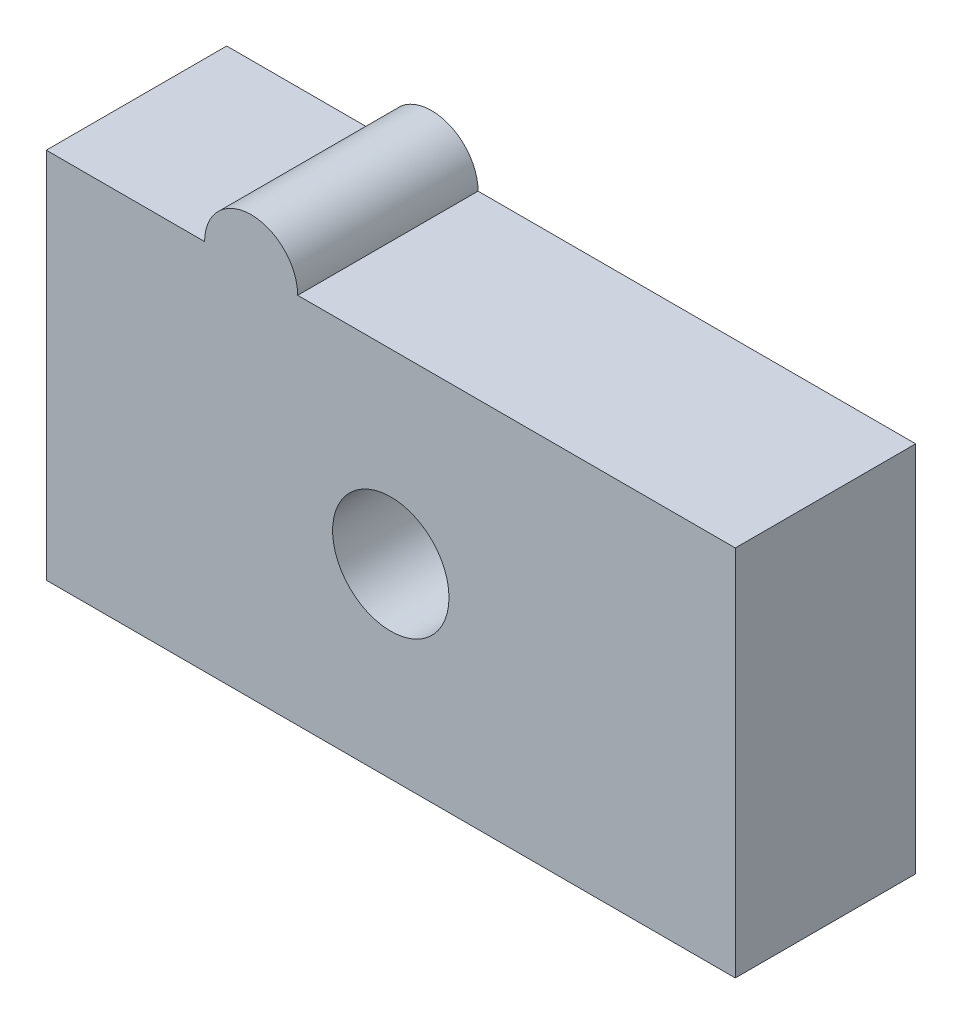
ISO-10303-21;
HEADER;
FILE_DESCRIPTION(('STEP AP214'),'2;1');
FILE_NAME('part.step','',(''),(''),'','','');
FILE_SCHEMA(('AUTOMOTIVE_DESIGN { 1 0 10303 214 1 1 1 1 }'));
ENDSEC;
DATA;
#1=APPLICATION_CONTEXT('core data for automotive mechanical design processes');
#2=APPLICATION_PROTOCOL_DEFINITION('international standard','automotive_design',2000,#1);
#3=PRODUCT_CONTEXT('',#1,'mechanical');
#4=PRODUCT('Part','Part','',(#3));
#5=PRODUCT_RELATED_PRODUCT_CATEGORY('part','',(#4));
#6=PRODUCT_DEFINITION_FORMATION('','',#4);
#7=PRODUCT_DEFINITION_CONTEXT('part definition',#1,'design');
#8=PRODUCT_DEFINITION('design','',#6,#7);
#9=PRODUCT_DEFINITION_SHAPE('','',#8);
#10=(LENGTH_UNIT() NAMED_UNIT(*) SI_UNIT(.MILLI.,.METRE.));
#11=(NAMED_UNIT(*) PLANE_ANGLE_UNIT() SI_UNIT($,.RADIAN.));
#12=(NAMED_UNIT(*) SI_UNIT($,.STERADIAN.) SOLID_ANGLE_UNIT());
#13=UNCERTAINTY_MEASURE_WITH_UNIT(LENGTH_MEASURE(1.E-05),#10,'distance_accuracy_value','');
#14=(GEOMETRIC_REPRESENTATION_CONTEXT(3) GLOBAL_UNCERTAINTY_ASSIGNED_CONTEXT((#13)) GLOBAL_UNIT_ASSIGNED_CONTEXT((#10,
#11,#12)) REPRESENTATION_CONTEXT('',''));
#15=CARTESIAN_POINT('',(0.,0.,0.));
#16=DIRECTION('',(0.,0.,1.));
#17=DIRECTION('',(1.,0.,0.));
#18=AXIS2_PLACEMENT_3D('',#15,#16,#17);
#19=CARTESIAN_POINT('',(-3.,-10.,3.875));
#20=DIRECTION('',(0.,0.,-1.));
#21=DIRECTION('',(-1.,0.,0.));
#22=AXIS2_PLACEMENT_3D('',#19,#20,#21);
#23=CYLINDRICAL_SURFACE('',#22,1.);
#24=CARTESIAN_POINT('',(-3.,-10.,0.));
#25=DIRECTION('',(0.,0.,1.));
#26=DIRECTION('',(1.,0.,0.));
#27=AXIS2_PLACEMENT_3D('',#24,#25,#26);
#28=CIRCLE('',#27,1.);
#29=CARTESIAN_POINT('',(-2.,-10.,0.));
#30=VERTEX_POINT('',#29);
#31=CARTESIAN_POINT('',(-4.,-10.,0.));
#32=VERTEX_POINT('',#31);
#33=EDGE_CURVE('E88',#30,#32,#28,.T.);
#34=ORIENTED_EDGE('',*,*,#33,.T.);
#35=DIRECTION('',(0.,0.,-1.));
#36=VECTOR('',#35,1.);
#37=CARTESIAN_POINT('',(-4.,-10.,3.875));
#38=LINE('',#37,#36);
#39=CARTESIAN_POINT('',(-4.,-10.,3.875));
#40=VERTEX_POINT('',#39);
#41=EDGE_CURVE('E11',#40,#32,#38,.T.);
#42=ORIENTED_EDGE('',*,*,#41,.F.);
#43=CARTESIAN_POINT('',(-3.,-10.,3.875));
#44=DIRECTION('',(0.,0.,1.));
#45=DIRECTION('',(1.,0.,0.));
#46=AXIS2_PLACEMENT_3D('',#43,#44,#45);
#47=CIRCLE('',#46,1.);
#48=CARTESIAN_POINT('',(-2.,-10.,3.875));
#49=VERTEX_POINT('',#48);
#50=EDGE_CURVE('E116',#49,#40,#47,.T.);
#51=ORIENTED_EDGE('',*,*,#50,.F.);
#52=DIRECTION('',(0.,0.,-1.));
#53=VECTOR('',#52,1.);
#54=CARTESIAN_POINT('',(-2.,-10.,3.875));
#55=LINE('',#54,#53);
#56=EDGE_CURVE('E101',#49,#30,#55,.T.);
#57=ORIENTED_EDGE('',*,*,#56,.T.);
#58=EDGE_LOOP('',(#34,#42,#51,#57));
#59=FACE_BOUND('',#58,.T.);
#60=ADVANCED_FACE('F32',(#59),#23,.T.);
#61=CARTESIAN_POINT('',(-7.4,-10.,3.875));
#62=DIRECTION('',(0.,-1.,0.));
#63=DIRECTION('',(1.,0.,0.));
#64=AXIS2_PLACEMENT_3D('',#61,#62,#63);
#65=PLANE('',#64);
#66=DIRECTION('',(-1.,0.,0.));
#67=VECTOR('',#66,1.);
#68=CARTESIAN_POINT('',(-7.4,-10.,0.));
#69=LINE('',#68,#67);
#70=CARTESIAN_POINT('',(-7.4,-10.,0.));
#71=VERTEX_POINT('',#70);
#72=EDGE_CURVE('E84',#32,#71,#69,.T.);
#73=ORIENTED_EDGE('',*,*,#72,.T.);
#74=DIRECTION('',(0.,0.,-1.));
#75=VECTOR('',#74,1.);
#76=CARTESIAN_POINT('',(-7.4,-10.,3.875));
#77=LINE('',#76,#75);
#78=CARTESIAN_POINT('',(-7.4,-10.,3.875));
#79=VERTEX_POINT('',#78);
#80=EDGE_CURVE('E39',#79,#71,#77,.T.);
#81=ORIENTED_EDGE('',*,*,#80,.F.);
#82=DIRECTION('',(-1.,0.,0.));
#83=VECTOR('',#82,1.);
#84=CARTESIAN_POINT('',(-7.4,-10.,3.875));
#85=LINE('',#84,#83);
#86=EDGE_CURVE('E97',#40,#79,#85,.T.);
#87=ORIENTED_EDGE('',*,*,#86,.F.);
#88=ORIENTED_EDGE('',*,*,#41,.T.);
#89=EDGE_LOOP('',(#73,#81,#87,#88));
#90=FACE_BOUND('',#89,.T.);
#91=ADVANCED_FACE('F96',(#90),#65,.F.);
#92=CARTESIAN_POINT('',(-7.4,-18.,3.875));
#93=DIRECTION('',(1.,0.,0.));
#94=DIRECTION('',(0.,0.,-1.));
#95=AXIS2_PLACEMENT_3D('',#92,#93,#94);
#96=PLANE('',#95);
#97=DIRECTION('',(0.,-1.,0.));
#98=VECTOR('',#97,1.);
#99=CARTESIAN_POINT('',(-7.4,-18.,0.));
#100=LINE('',#99,#98);
#101=CARTESIAN_POINT('',(-7.4,-18.,0.));
#102=VERTEX_POINT('',#101);
#103=EDGE_CURVE('E90',#71,#102,#100,.T.);
#104=ORIENTED_EDGE('',*,*,#103,.T.);
#105=DIRECTION('',(0.,0.,-1.));
#106=VECTOR('',#105,1.);
#107=CARTESIAN_POINT('',(-7.4,-18.,3.875));
#108=LINE('',#107,#106);
#109=CARTESIAN_POINT('',(-7.4,-18.,3.875));
#110=VERTEX_POINT('',#109);
#111=EDGE_CURVE('E132',#110,#102,#108,.T.);
#112=ORIENTED_EDGE('',*,*,#111,.F.);
#113=DIRECTION('',(0.,-1.,0.));
#114=VECTOR('',#113,1.);
#115=CARTESIAN_POINT('',(-7.4,-18.,3.875));
#116=LINE('',#115,#114);
#117=EDGE_CURVE('E119',#79,#110,#116,.T.);
#118=ORIENTED_EDGE('',*,*,#117,.F.);
#119=ORIENTED_EDGE('',*,*,#80,.T.);
#120=EDGE_LOOP('',(#104,#112,#118,#119));
#121=FACE_BOUND('',#120,.T.);
#122=ADVANCED_FACE('F136',(#121),#96,.F.);
#123=CARTESIAN_POINT('',(-7.4,-18.,3.875));
#124=DIRECTION('',(0.,1.,0.));
#125=DIRECTION('',(0.,0.,1.));
#126=AXIS2_PLACEMENT_3D('',#123,#124,#125);
#127=PLANE('',#126);
#128=DIRECTION('',(1.,0.,0.));
#129=VECTOR('',#128,1.);
#130=CARTESIAN_POINT('',(-7.4,-18.,0.));
#131=LINE('',#130,#129);
#132=CARTESIAN_POINT('',(7.4,-18.,0.));
#133=VERTEX_POINT('',#132);
#134=EDGE_CURVE('E110',#102,#133,#131,.T.);
#135=ORIENTED_EDGE('',*,*,#134,.T.);
#136=DIRECTION('',(0.,0.,-1.));
#137=VECTOR('',#136,1.);
#138=CARTESIAN_POINT('',(7.4,-18.,3.875));
#139=LINE('',#138,#137);
#140=CARTESIAN_POINT('',(7.4,-18.,3.875));
#141=VERTEX_POINT('',#140);
#142=EDGE_CURVE('E129',#141,#133,#139,.T.);
#143=ORIENTED_EDGE('',*,*,#142,.F.);
#144=DIRECTION('',(1.,0.,0.));
#145=VECTOR('',#144,1.);
#146=CARTESIAN_POINT('',(-7.4,-18.,3.875));
#147=LINE('',#146,#145);
#148=EDGE_CURVE('E121',#110,#141,#147,.T.);
#149=ORIENTED_EDGE('',*,*,#148,.F.);
#150=ORIENTED_EDGE('',*,*,#111,.T.);
#151=EDGE_LOOP('',(#135,#143,#149,#150));
#152=FACE_BOUND('',#151,.T.);
#153=ADVANCED_FACE('F142',(#152),#127,.F.);
#154=CARTESIAN_POINT('',(7.4,-18.,3.875));
#155=DIRECTION('',(-1.,0.,0.));
#156=DIRECTION('',(0.,0.,1.));
#157=AXIS2_PLACEMENT_3D('',#154,#155,#156);
#158=PLANE('',#157);
#159=DIRECTION('',(0.,1.,0.));
#160=VECTOR('',#159,1.);
#161=CARTESIAN_POINT('',(7.4,-18.,0.));
#162=LINE('',#161,#160);
#163=CARTESIAN_POINT('',(7.4,-10.,0.));
#164=VERTEX_POINT('',#163);
#165=EDGE_CURVE('E112',#133,#164,#162,.T.);
#166=ORIENTED_EDGE('',*,*,#165,.T.);
#167=DIRECTION('',(0.,0.,-1.));
#168=VECTOR('',#167,1.);
#169=CARTESIAN_POINT('',(7.4,-10.,3.875));
#170=LINE('',#169,#168);
#171=CARTESIAN_POINT('',(7.4,-10.,3.875));
#172=VERTEX_POINT('',#171);
#173=EDGE_CURVE('E126',#172,#164,#170,.T.);
#174=ORIENTED_EDGE('',*,*,#173,.F.);
#175=DIRECTION('',(0.,1.,0.));
#176=VECTOR('',#175,1.);
#177=CARTESIAN_POINT('',(7.4,-18.,3.875));
#178=LINE('',#177,#176);
#179=EDGE_CURVE('E51',#141,#172,#178,.T.);
#180=ORIENTED_EDGE('',*,*,#179,.F.);
#181=ORIENTED_EDGE('',*,*,#142,.T.);
#182=EDGE_LOOP('',(#166,#174,#180,#181));
#183=FACE_BOUND('',#182,.T.);
#184=ADVANCED_FACE('F145',(#183),#158,.F.);
#185=CARTESIAN_POINT('',(-2.,-10.,3.875));
#186=DIRECTION('',(0.,-1.,0.));
#187=DIRECTION('',(1.,0.,0.));
#188=AXIS2_PLACEMENT_3D('',#185,#186,#187);
#189=PLANE('',#188);
#190=DIRECTION('',(-1.,0.,0.));
#191=VECTOR('',#190,1.);
#192=CARTESIAN_POINT('',(-2.,-10.,0.));
#193=LINE('',#192,#191);
#194=EDGE_CURVE('E114',#164,#30,#193,.T.);
#195=ORIENTED_EDGE('',*,*,#194,.T.);
#196=ORIENTED_EDGE('',*,*,#56,.F.);
#197=DIRECTION('',(-1.,0.,0.));
#198=VECTOR('',#197,1.);
#199=CARTESIAN_POINT('',(-2.,-10.,3.875));
#200=LINE('',#199,#198);
#201=EDGE_CURVE('E46',#172,#49,#200,.T.);
#202=ORIENTED_EDGE('',*,*,#201,.F.);
#203=ORIENTED_EDGE('',*,*,#173,.T.);
#204=EDGE_LOOP('',(#195,#196,#202,#203));
#205=FACE_BOUND('',#204,.T.);
#206=ADVANCED_FACE('F147',(#205),#189,.F.);
#207=CARTESIAN_POINT('',(-3.,-10.,3.875));
#208=DIRECTION('',(0.,0.,1.));
#209=DIRECTION('',(1.,0.,0.));
#210=AXIS2_PLACEMENT_3D('',#207,#208,#209);
#211=PLANE('',#210);
#212=CARTESIAN_POINT('',(0.,-14.,3.875));
#213=DIRECTION('',(0.,0.,1.));
#214=DIRECTION('',(1.,0.,0.));
#215=AXIS2_PLACEMENT_3D('',#212,#213,#214);
#216=CIRCLE('',#215,1.25);
#217=CARTESIAN_POINT('',(1.25,-14.,3.875));
#218=VERTEX_POINT('',#217);
#219=EDGE_CURVE('E254',#218,#218,#216,.T.);
#220=ORIENTED_EDGE('',*,*,#219,.F.);
#221=EDGE_LOOP('',(#220));
#222=FACE_BOUND('',#221,.T.);
#223=ORIENTED_EDGE('',*,*,#50,.T.);
#224=ORIENTED_EDGE('',*,*,#86,.T.);
#225=ORIENTED_EDGE('',*,*,#117,.T.);
#226=ORIENTED_EDGE('',*,*,#148,.T.);
#227=ORIENTED_EDGE('',*,*,#179,.T.);
#228=ORIENTED_EDGE('',*,*,#201,.T.);
#229=EDGE_LOOP('',(#223,#224,#225,#226,#227,#228));
#230=FACE_BOUND('',#229,.T.);
#231=ADVANCED_FACE('F139',(#222,#230),#211,.T.);
#232=CARTESIAN_POINT('',(-3.,-10.,0.));
#233=DIRECTION('',(0.,0.,1.));
#234=DIRECTION('',(1.,0.,0.));
#235=AXIS2_PLACEMENT_3D('',#232,#233,#234);
#236=PLANE('',#235);
#237=CARTESIAN_POINT('',(0.,-14.,0.));
#238=DIRECTION('',(0.,0.,1.));
#239=DIRECTION('',(1.,0.,0.));
#240=AXIS2_PLACEMENT_3D('',#237,#238,#239);
#241=CIRCLE('',#240,1.25);
#242=CARTESIAN_POINT('',(1.25,-14.,0.));
#243=VERTEX_POINT('',#242);
#244=EDGE_CURVE('E251',#243,#243,#241,.T.);
#245=ORIENTED_EDGE('',*,*,#244,.T.);
#246=EDGE_LOOP('',(#245));
#247=FACE_BOUND('',#246,.T.);
#248=CARTESIAN_POINT('',(-4.99377661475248,-16.3048199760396,0.));
#249=DIRECTION('',(0.,0.,-1.));
#250=DIRECTION('',(-1.,0.,0.));
#251=AXIS2_PLACEMENT_3D('',#248,#249,#250);
#252=CIRCLE('',#251,0.999999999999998);
#253=CARTESIAN_POINT('',(-5.99377661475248,-16.3048199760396,0.));
#254=VERTEX_POINT('',#253);
#255=EDGE_CURVE('E256',#254,#254,#252,.T.);
#256=ORIENTED_EDGE('',*,*,#255,.F.);
#257=EDGE_LOOP('',(#256));
#258=FACE_BOUND('',#257,.T.);
#259=CARTESIAN_POINT('',(4.99377661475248,-11.6951800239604,0.));
#260=DIRECTION('',(0.,0.,-1.));
#261=DIRECTION('',(-1.,0.,0.));
#262=AXIS2_PLACEMENT_3D('',#259,#260,#261);
#263=CIRCLE('',#262,0.999999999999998);
#264=CARTESIAN_POINT('',(3.99377661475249,-11.6951800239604,0.));
#265=VERTEX_POINT('',#264);
#266=EDGE_CURVE('E105',#265,#265,#263,.T.);
#267=ORIENTED_EDGE('',*,*,#266,.F.);
#268=EDGE_LOOP('',(#267));
#269=FACE_BOUND('',#268,.T.);
#270=ORIENTED_EDGE('',*,*,#33,.F.);
#271=ORIENTED_EDGE('',*,*,#194,.F.);
#272=ORIENTED_EDGE('',*,*,#165,.F.);
#273=ORIENTED_EDGE('',*,*,#134,.F.);
#274=ORIENTED_EDGE('',*,*,#103,.F.);
#275=ORIENTED_EDGE('',*,*,#72,.F.);
#276=EDGE_LOOP('',(#270,#271,#272,#273,#274,#275));
#277=FACE_BOUND('',#276,.T.);
#278=ADVANCED_FACE('F85',(#247,#258,#269,#277),#236,.F.);
#279=CARTESIAN_POINT('',(4.99377661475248,-11.6951800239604,3.));
#280=DIRECTION('',(0.,0.,-1.));
#281=DIRECTION('',(-1.,0.,0.));
#282=AXIS2_PLACEMENT_3D('',#279,#280,#281);
#283=CYLINDRICAL_SURFACE('',#282,0.999999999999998);
#284=CARTESIAN_POINT('',(4.99377661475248,-11.6951800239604,3.));
#285=DIRECTION('',(0.,0.,-1.));
#286=DIRECTION('',(-1.,0.,0.));
#287=AXIS2_PLACEMENT_3D('',#284,#285,#286);
#288=CIRCLE('',#287,0.999999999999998);
#289=CARTESIAN_POINT('',(3.99377661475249,-11.6951800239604,3.));
#290=VERTEX_POINT('',#289);
#291=EDGE_CURVE('E102',#290,#290,#288,.T.);
#292=ORIENTED_EDGE('',*,*,#291,.F.);
#293=EDGE_LOOP('',(#292));
#294=FACE_BOUND('',#293,.T.);
#295=ORIENTED_EDGE('',*,*,#266,.T.);
#296=EDGE_LOOP('',(#295));
#297=FACE_BOUND('',#296,.T.);
#298=ADVANCED_FACE('F194',(#294,#297),#283,.F.);
#299=CARTESIAN_POINT('',(4.99377661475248,-11.6951800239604,3.));
#300=DIRECTION('',(0.,0.,-1.));
#301=DIRECTION('',(-1.,0.,0.));
#302=AXIS2_PLACEMENT_3D('',#299,#300,#301);
#303=PLANE('',#302);
#304=ORIENTED_EDGE('',*,*,#291,.T.);
#305=EDGE_LOOP('',(#304));
#306=FACE_BOUND('',#305,.T.);
#307=ADVANCED_FACE('F204',(#306),#303,.T.);
#308=CARTESIAN_POINT('',(-4.99377661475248,-16.3048199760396,3.));
#309=DIRECTION('',(0.,0.,-1.));
#310=DIRECTION('',(-1.,0.,0.));
#311=AXIS2_PLACEMENT_3D('',#308,#309,#310);
#312=CYLINDRICAL_SURFACE('',#311,0.999999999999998);
#313=CARTESIAN_POINT('',(-4.99377661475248,-16.3048199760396,3.));
#314=DIRECTION('',(0.,0.,-1.));
#315=DIRECTION('',(-1.,0.,0.));
#316=AXIS2_PLACEMENT_3D('',#313,#314,#315);
#317=CIRCLE('',#316,0.999999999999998);
#318=CARTESIAN_POINT('',(-5.99377661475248,-16.3048199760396,3.));
#319=VERTEX_POINT('',#318);
#320=EDGE_CURVE('E261',#319,#319,#317,.T.);
#321=ORIENTED_EDGE('',*,*,#320,.F.);
#322=EDGE_LOOP('',(#321));
#323=FACE_BOUND('',#322,.T.);
#324=ORIENTED_EDGE('',*,*,#255,.T.);
#325=EDGE_LOOP('',(#324));
#326=FACE_BOUND('',#325,.T.);
#327=ADVANCED_FACE('F214',(#323,#326),#312,.F.);
#328=CARTESIAN_POINT('',(-4.99377661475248,-16.3048199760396,3.));
#329=DIRECTION('',(0.,0.,-1.));
#330=DIRECTION('',(-1.,0.,0.));
#331=AXIS2_PLACEMENT_3D('',#328,#329,#330);
#332=PLANE('',#331);
#333=ORIENTED_EDGE('',*,*,#320,.T.);
#334=EDGE_LOOP('',(#333));
#335=FACE_BOUND('',#334,.T.);
#336=ADVANCED_FACE('F224',(#335),#332,.T.);
#337=CARTESIAN_POINT('',(0.,-14.,0.));
#338=DIRECTION('',(0.,0.,1.));
#339=DIRECTION('',(1.,0.,0.));
#340=AXIS2_PLACEMENT_3D('',#337,#338,#339);
#341=CYLINDRICAL_SURFACE('',#340,1.25);
#342=ORIENTED_EDGE('',*,*,#244,.F.);
#343=EDGE_LOOP('',(#342));
#344=FACE_BOUND('',#343,.T.);
#345=ORIENTED_EDGE('',*,*,#219,.T.);
#346=EDGE_LOOP('',(#345));
#347=FACE_BOUND('',#346,.T.);
#348=ADVANCED_FACE('F234',(#344,#347),#341,.F.);
#349=CLOSED_SHELL('',(#60,#91,#122,#153,#184,#206,#231,#278,#298,#307,#327,#336,#348));
#350=MANIFOLD_SOLID_BREP('B2',#349);
#351=ADVANCED_BREP_SHAPE_REPRESENTATION('',(#18,#350),#14);
#352=SHAPE_DEFINITION_REPRESENTATION(#9,#351);
ENDSEC;
END-ISO-10303-21;
